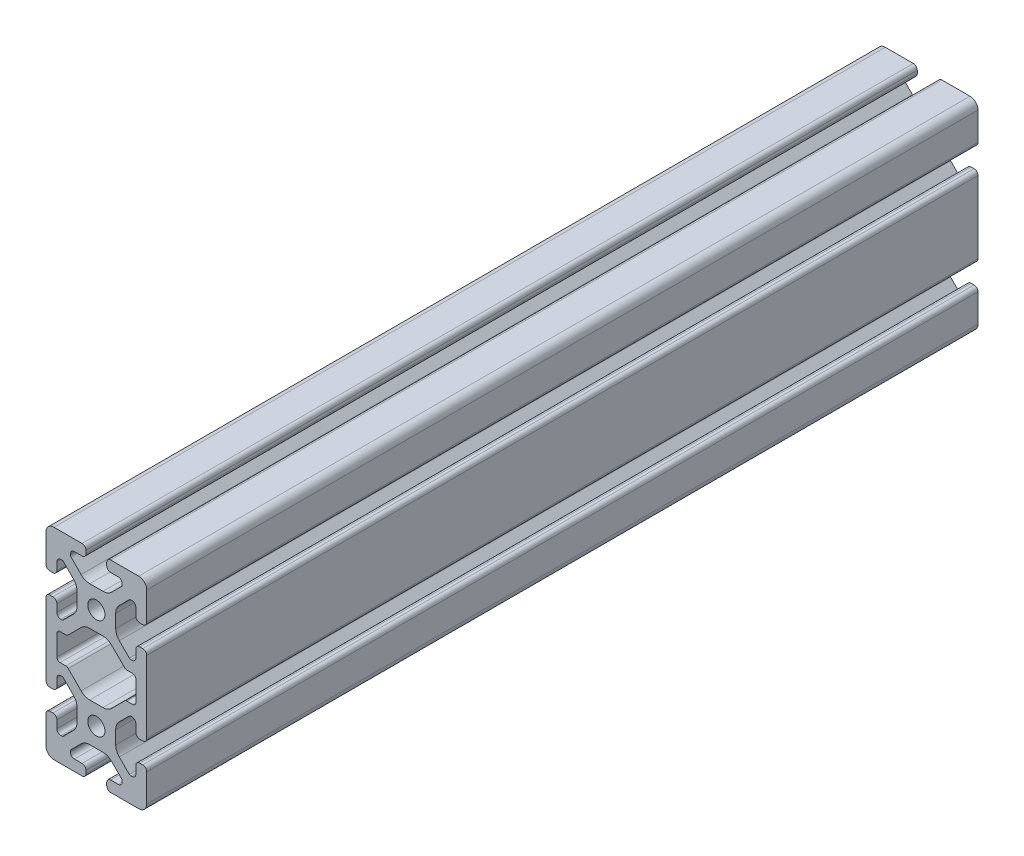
from build123d import *

# Parameters (mm, degrees)
SKETCH1_R           = 3.405
BOSS_EXTRUDE1_DEPTH = 3048
SKETCH26_W          = 40
SKETCH26_H          = 80.80011746
CUT_1_3FT_DEPTH     = 2135.537177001
SKETCH33_W          = 40
SKETCH33_H          = 80.80011746
CUT_2_3FT_DEPTH     = 1221.839317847
SKETCH41_W          = 40
SKETCH41_H          = 80.80011746
CUT_3_1FT_DEPTH     = 892.246879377
SKETCH50_W          = 40
SKETCH50_H          = 80.80011746
CUT_4_1FT_DEPTH     = 563.367708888


with BuildPart() as part:
    # Sketch1 → Boss-Extrude1 (new body)
    with BuildSketch(Plane(origin=(0, 0, -3048), x_dir=(-1, 0, 0), z_dir=(0, 0, -1))):
        with BuildLine():
            Line((16.83, 60), (5.69044933, 60))
            ThreePointArc((5.69044933, 60), (4.580291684, 59.540157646), (4.12044933, 58.43))
            Line((4.12044933, 58.43), (4.12044933, 57.25))
            ThreePointArc((4.12044933, 57.25), (4.580291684, 56.139842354), (5.69044933, 55.68))
            Line((5.69044933, 55.68), (8.7153995, 55.68))
            ThreePointArc((8.7153995, 55.68), (9.825557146, 55.220157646), (10.2853995, 54.11))
            Line((10.2853995, 54.11), (10.2853995, 53.654903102))
            ThreePointArc((10.2853995, 53.654903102), (10.227547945, 53.364063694), (10.062800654, 53.117501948))
            Line((10.062800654, 53.117501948), (6.055092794, 49.109794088))
            ThreePointArc((6.055092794, 49.109794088), (4.47691877, 48.055291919), (2.615335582, 47.685))
            Line((2.615335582, 47.685), (-2.615335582, 47.685))
            ThreePointArc((-2.615335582, 47.685), (-4.47691877, 48.055291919), (-6.055092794, 49.109794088))
            Line((-6.055092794, 49.109794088), (-10.062800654, 53.117501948))
            ThreePointArc((-10.062800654, 53.117501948), (-10.227547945, 53.364063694), (-10.2853995, 53.654903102))
            Line((-10.2853995, 53.654903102), (-10.2853995, 54.11))
            ThreePointArc((-10.2853995, 54.11), (-9.825557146, 55.220157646), (-8.7153995, 55.68))
            Line((-8.7153995, 55.68), (-5.69044933, 55.68))
            ThreePointArc((-5.69044933, 55.68), (-4.580291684, 56.139842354), (-4.12044933, 57.25))
            Line((-4.12044933, 57.25), (-4.12044933, 58.43))
            ThreePointArc((-4.12044933, 58.43), (-4.580291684, 59.540157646), (-5.69044933, 60))
            Line((-5.69044933, 60), (-16.83, 60))
            ThreePointArc((-16.83, 60), (-19.071528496, 59.071528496), (-20, 56.83))
            Line((-20, 56.83), (-20, 45.69044933))
            ThreePointArc((-20, 45.69044933), (-19.540157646, 44.580291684), (-18.43, 44.12044933))
            Line((-18.43, 44.12044933), (-17.25, 44.12044933))
            ThreePointArc((-17.25, 44.12044933), (-16.139842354, 44.580291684), (-15.68, 45.69044933))
            Line((-15.68, 45.69044933), (-15.68, 48.7153995))
            ThreePointArc((-15.68, 48.7153995), (-15.220157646, 49.825557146), (-14.11, 50.2853995))
            Line((-14.11, 50.2853995), (-13.652670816, 50.2853995))
            ThreePointArc((-13.652670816, 50.2853995), (-13.361831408, 50.227547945), (-13.115269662, 50.062800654))
            Line((-13.115269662, 50.062800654), (-9.109794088, 46.05732508))
            ThreePointArc((-9.109794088, 46.05732508), (-8.055291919, 44.479151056), (-7.685, 42.617567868))
            Line((-7.685, 42.617567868), (-7.685, 37.384664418))
            ThreePointArc((-7.685, 37.384664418), (-8.055291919, 35.52308123), (-9.109794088, 33.944907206))
            Line((-9.109794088, 33.944907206), (-13.117501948, 29.937199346))
            ThreePointArc((-13.117501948, 29.937199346), (-13.364063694, 29.772452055), (-13.654903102, 29.7146005))
            Line((-13.654903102, 29.7146005), (-14.11, 29.7146005))
            ThreePointArc((-14.11, 29.7146005), (-15.220157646, 30.174442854), (-15.68, 31.2846005))
            Line((-15.68, 31.2846005), (-15.68, 34.30955067))
            ThreePointArc((-15.68, 34.30955067), (-16.139842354, 35.419708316), (-17.25, 35.87955067))
            Line((-17.25, 35.87955067), (-18.43, 35.87955067))
            ThreePointArc((-18.43, 35.87955067), (-19.540157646, 35.419708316), (-20, 34.30955067))
            Line((-20, 34.30955067), (-20, 5.69044933))
            ThreePointArc((-20, 5.69044933), (-19.540157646, 4.580291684), (-18.43, 4.12044933))
            Line((-18.43, 4.12044933), (-17.25, 4.12044933))
            ThreePointArc((-17.25, 4.12044933), (-16.139842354, 4.580291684), (-15.68, 5.69044933))
            Line((-15.68, 5.69044933), (-15.68, 8.7153995))
            ThreePointArc((-15.68, 8.7153995), (-15.220157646, 9.825557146), (-14.11, 10.2853995))
            Line((-14.11, 10.2853995), (-13.654903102, 10.2853995))
            ThreePointArc((-13.654903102, 10.2853995), (-13.364063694, 10.227547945), (-13.117501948, 10.062800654))
            Line((-13.117501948, 10.062800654), (-9.109794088, 6.055092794))
            ThreePointArc((-9.109794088, 6.055092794), (-8.055291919, 4.47691877), (-7.685, 2.615335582))
            Line((-7.685, 2.615335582), (-7.685, -2.615335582))
            ThreePointArc((-7.685, -2.615335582), (-8.055291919, -4.47691877), (-9.109794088, -6.055092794))
            Line((-9.109794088, -6.055092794), (-13.117501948, -10.062800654))
            ThreePointArc((-13.117501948, -10.062800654), (-13.364063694, -10.227547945), (-13.654903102, -10.2853995))
            Line((-13.654903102, -10.2853995), (-14.11, -10.2853995))
            ThreePointArc((-14.11, -10.2853995), (-15.220157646, -9.825557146), (-15.68, -8.7153995))
            Line((-15.68, -8.7153995), (-15.68, -5.69044933))
            ThreePointArc((-15.68, -5.69044933), (-16.139842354, -4.580291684), (-17.25, -4.12044933))
            Line((-17.25, -4.12044933), (-18.43, -4.12044933))
            ThreePointArc((-18.43, -4.12044933), (-19.540157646, -4.580291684), (-20, -5.69044933))
            Line((-20, -5.69044933), (-20, -16.83))
            ThreePointArc((-20, -16.83), (-19.071528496, -19.071528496), (-16.83, -20))
            Line((-16.83, -20), (-5.69044933, -20))
            ThreePointArc((-5.69044933, -20), (-4.580291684, -19.540157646), (-4.12044933, -18.43))
            Line((-4.12044933, -18.43), (-4.12044933, -17.25))
            ThreePointArc((-4.12044933, -17.25), (-4.580291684, -16.139842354), (-5.69044933, -15.68))
            Line((-5.69044933, -15.68), (-8.7153995, -15.68))
            ThreePointArc((-8.7153995, -15.68), (-9.825557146, -15.220157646), (-10.2853995, -14.11))
            Line((-10.2853995, -14.11), (-10.2853995, -13.654903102))
            ThreePointArc((-10.2853995, -13.654903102), (-10.227547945, -13.364063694), (-10.062800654, -13.117501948))
            Line((-10.062800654, -13.117501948), (-6.055092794, -9.109794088))
            ThreePointArc((-6.055092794, -9.109794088), (-4.47691877, -8.055291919), (-2.615335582, -7.685))
            Line((-2.615335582, -7.685), (2.615335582, -7.685))
            ThreePointArc((2.615335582, -7.685), (4.47691877, -8.055291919), (6.055092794, -9.109794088))
            Line((6.055092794, -9.109794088), (10.062800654, -13.117501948))
            ThreePointArc((10.062800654, -13.117501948), (10.227547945, -13.364063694), (10.2853995, -13.654903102))
            Line((10.2853995, -13.654903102), (10.2853995, -14.11))
            ThreePointArc((10.2853995, -14.11), (9.825557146, -15.220157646), (8.7153995, -15.68))
            Line((8.7153995, -15.68), (5.69044933, -15.68))
            ThreePointArc((5.69044933, -15.68), (4.580291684, -16.139842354), (4.12044933, -17.25))
            Line((4.12044933, -17.25), (4.12044933, -18.43))
            ThreePointArc((4.12044933, -18.43), (4.580291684, -19.540157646), (5.69044933, -20))
            Line((5.69044933, -20), (16.83, -20))
            ThreePointArc((16.83, -20), (19.071528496, -19.071528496), (20, -16.83))
            Line((20, -16.83), (20, -5.69044933))
            ThreePointArc((20, -5.69044933), (19.540157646, -4.580291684), (18.43, -4.12044933))
            Line((18.43, -4.12044933), (17.25, -4.12044933))
            ThreePointArc((17.25, -4.12044933), (16.139842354, -4.580291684), (15.68, -5.69044933))
            Line((15.68, -5.69044933), (15.68, -8.7153995))
            ThreePointArc((15.68, -8.7153995), (15.220157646, -9.825557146), (14.11, -10.2853995))
            Line((14.11, -10.2853995), (13.654903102, -10.2853995))
            ThreePointArc((13.654903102, -10.2853995), (13.364063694, -10.227547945), (13.117501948, -10.062800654))
            Line((13.117501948, -10.062800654), (9.109794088, -6.055092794))
            ThreePointArc((9.109794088, -6.055092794), (8.055291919, -4.47691877), (7.685, -2.615335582))
            Line((7.685, -2.615335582), (7.685, 2.615335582))
            ThreePointArc((7.685, 2.615335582), (8.055291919, 4.47691877), (9.109794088, 6.055092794))
            Line((9.109794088, 6.055092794), (13.117501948, 10.062800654))
            ThreePointArc((13.117501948, 10.062800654), (13.364063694, 10.227547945), (13.654903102, 10.2853995))
            Line((13.654903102, 10.2853995), (14.11, 10.2853995))
            ThreePointArc((14.11, 10.2853995), (15.220157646, 9.825557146), (15.68, 8.7153995))
            Line((15.68, 8.7153995), (15.68, 5.69044933))
            ThreePointArc((15.68, 5.69044933), (16.139842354, 4.580291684), (17.25, 4.12044933))
            Line((17.25, 4.12044933), (18.43, 4.12044933))
            ThreePointArc((18.43, 4.12044933), (19.540157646, 4.580291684), (20, 5.69044933))
            Line((20, 5.69044933), (20, 34.30955067))
            ThreePointArc((20, 34.30955067), (19.540157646, 35.419708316), (18.43, 35.87955067))
            Line((18.43, 35.87955067), (17.25, 35.87955067))
            ThreePointArc((17.25, 35.87955067), (16.139842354, 35.419708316), (15.68, 34.30955067))
            Line((15.68, 34.30955067), (15.68, 31.2846005))
            ThreePointArc((15.68, 31.2846005), (15.220157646, 30.174442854), (14.11, 29.7146005))
            Line((14.11, 29.7146005), (13.654903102, 29.7146005))
            ThreePointArc((13.654903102, 29.7146005), (13.364063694, 29.772452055), (13.117501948, 29.937199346))
            Line((13.117501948, 29.937199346), (9.109794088, 33.944907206))
            ThreePointArc((9.109794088, 33.944907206), (8.055291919, 35.52308123), (7.685, 37.384664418))
            Line((7.685, 37.384664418), (7.685, 42.615335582))
            ThreePointArc((7.685, 42.615335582), (8.055291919, 44.47691877), (9.109794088, 46.055092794))
            Line((9.109794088, 46.055092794), (13.117501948, 50.062800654))
            ThreePointArc((13.117501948, 50.062800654), (13.364063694, 50.227547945), (13.654903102, 50.2853995))
            Line((13.654903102, 50.2853995), (14.11, 50.2853995))
            ThreePointArc((14.11, 50.2853995), (15.220157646, 49.825557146), (15.68, 48.7153995))
            Line((15.68, 48.7153995), (15.68, 45.69044933))
            ThreePointArc((15.68, 45.69044933), (16.139842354, 44.580291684), (17.25, 44.12044933))
            Line((17.25, 44.12044933), (18.43, 44.12044933))
            ThreePointArc((18.43, 44.12044933), (19.540157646, 44.580291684), (20, 45.69044933))
            Line((20, 45.69044933), (20, 56.83))
            ThreePointArc((20, 56.83), (19.071528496, 59.071528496), (16.83, 60))
        make_face()
        with Locations(Location((0, 0, 0), (0, 0, 180))):
            Circle(SKETCH1_R, mode=Mode.SUBTRACT)
        with Locations(Location((0, 40, 0), (0, 0, 180))):
            Circle(SKETCH1_R, mode=Mode.SUBTRACT)
        with BuildLine():
            Line((14.41, 14.65864833), (12.129998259, 14.65864833))
            ThreePointArc((12.129998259, 14.65864833), (11.608780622, 14.546764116), (11.179399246, 14.230824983))
            Line((11.179399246, 14.230824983), (6.055092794, 9.109794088))
            ThreePointArc((6.055092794, 9.109794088), (4.47691877, 8.055291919), (2.615335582, 7.685))
            Line((2.615335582, 7.685), (-2.615335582, 7.685))
            ThreePointArc((-2.615335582, 7.685), (-4.47691877, 8.055291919), (-6.055092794, 9.109794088))
            Line((-6.055092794, 9.109794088), (-11.231972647, 14.286673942))
            ThreePointArc((-11.231972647, 14.286673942), (-11.6439903, 14.561975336), (-12.129998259, 14.65864833))
            Line((-12.129998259, 14.65864833), (-14.41, 14.65864833))
            ThreePointArc((-14.41, 14.65864833), (-15.308025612, 15.030622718), (-15.68, 15.92864833))
            Line((-15.68, 15.92864833), (-15.68, 24.07135167))
            ThreePointArc((-15.68, 24.07135167), (-15.308025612, 24.969377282), (-14.41, 25.34135167))
            Line((-14.41, 25.34135167), (-12.129998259, 25.34135167))
            ThreePointArc((-12.129998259, 25.34135167), (-11.6439903, 25.438024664), (-11.231972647, 25.713326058))
            Line((-11.231972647, 25.713326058), (-6.055092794, 30.890205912))
            ThreePointArc((-6.055092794, 30.890205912), (-4.47691877, 31.944708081), (-2.615335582, 32.315))
            Line((-2.615335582, 32.315), (2.617567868, 32.315))
            ThreePointArc((2.617567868, 32.315), (4.479151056, 31.944708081), (6.05732508, 30.890205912))
            Line((6.05732508, 30.890205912), (11.184160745, 25.763370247))
            ThreePointArc((11.184160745, 25.763370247), (11.612140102, 25.451641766), (12.129998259, 25.34135167))
            Line((12.129998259, 25.34135167), (14.41, 25.34135167))
            ThreePointArc((14.41, 25.34135167), (15.308025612, 24.969377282), (15.68, 24.07135167))
            Line((15.68, 24.07135167), (15.68, 15.92864833))
            ThreePointArc((15.68, 15.92864833), (15.308025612, 15.030622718), (14.41, 14.65864833))
        make_face(mode=Mode.SUBTRACT)
    extrude(amount=-BOSS_EXTRUDE1_DEPTH)

    # Sketch26 → Cut 1 - 3ft (cut, through all)
    with BuildSketch(Plane.XY.offset(-914.4)):
        with Locations((0, 19.59994127)):
            Rectangle(SKETCH26_W, SKETCH26_H)
    extrude(amount=CUT_1_3FT_DEPTH, mode=Mode.SUBTRACT)

    # Sketch33 → Cut 2 - 3ft (cut, through all)
    with BuildSketch(Plane.XY.offset(-1828.8)):
        with Locations((0, 19.59994127)):
            Rectangle(SKETCH33_W, SKETCH33_H)
    extrude(amount=CUT_2_3FT_DEPTH, mode=Mode.SUBTRACT)

    # Sketch41 → Cut 3 - 1ft (cut, through all)
    with BuildSketch(Plane.XY.offset(-2159)):
        with Locations((0, 19.59994127)):
            Rectangle(SKETCH41_W, SKETCH41_H)
    extrude(amount=CUT_3_1FT_DEPTH, mode=Mode.SUBTRACT)

    # Sketch50 → Cut 4 - 1ft (cut, through all)
    with BuildSketch(Plane.XY.offset(-2489.2)):
        with Locations((0, 19.59994127)):
            Rectangle(SKETCH50_W, SKETCH50_H)
    extrude(amount=-CUT_4_1FT_DEPTH, mode=Mode.SUBTRACT)


solid = part.part
